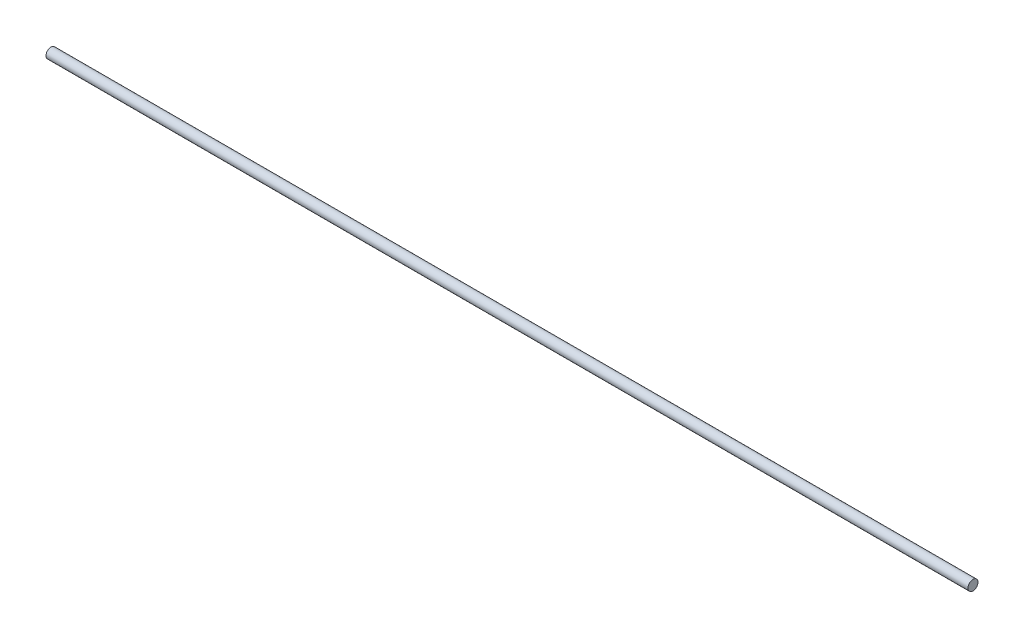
ISO-10303-21;
HEADER;
FILE_DESCRIPTION(('STEP AP214'),'2;1');
FILE_NAME('part.step','',(''),(''),'','','');
FILE_SCHEMA(('AUTOMOTIVE_DESIGN { 1 0 10303 214 1 1 1 1 }'));
ENDSEC;
DATA;
#1=APPLICATION_CONTEXT('core data for automotive mechanical design processes');
#2=APPLICATION_PROTOCOL_DEFINITION('international standard','automotive_design',2000,#1);
#3=PRODUCT_CONTEXT('',#1,'mechanical');
#4=PRODUCT('Part','Part','',(#3));
#5=PRODUCT_RELATED_PRODUCT_CATEGORY('part','',(#4));
#6=PRODUCT_DEFINITION_FORMATION('','',#4);
#7=PRODUCT_DEFINITION_CONTEXT('part definition',#1,'design');
#8=PRODUCT_DEFINITION('design','',#6,#7);
#9=PRODUCT_DEFINITION_SHAPE('','',#8);
#10=(LENGTH_UNIT() NAMED_UNIT(*) SI_UNIT(.MILLI.,.METRE.));
#11=(NAMED_UNIT(*) PLANE_ANGLE_UNIT() SI_UNIT($,.RADIAN.));
#12=(NAMED_UNIT(*) SI_UNIT($,.STERADIAN.) SOLID_ANGLE_UNIT());
#13=UNCERTAINTY_MEASURE_WITH_UNIT(LENGTH_MEASURE(1.E-05),#10,'distance_accuracy_value','');
#14=(GEOMETRIC_REPRESENTATION_CONTEXT(3) GLOBAL_UNCERTAINTY_ASSIGNED_CONTEXT((#13)) GLOBAL_UNIT_ASSIGNED_CONTEXT((#10,
#11,#12)) REPRESENTATION_CONTEXT('',''));
#15=CARTESIAN_POINT('',(0.,0.,0.));
#16=DIRECTION('',(0.,0.,1.));
#17=DIRECTION('',(1.,0.,0.));
#18=AXIS2_PLACEMENT_3D('',#15,#16,#17);
#19=CARTESIAN_POINT('',(1318.225,1.56141766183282E-09,-7.105427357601E-12));
#20=DIRECTION('',(-1.00000000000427,0.,0.));
#21=DIRECTION('',(0.,0.,1.));
#22=AXIS2_PLACEMENT_3D('',#19,#20,#21);
#23=CYLINDRICAL_SURFACE('',#22,14.3256);
#24=CARTESIAN_POINT('',(1318.225,1.56141766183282E-09,-7.105427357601E-12));
#25=DIRECTION('',(1.00000000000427,0.,0.));
#26=DIRECTION('',(0.,0.,-1.));
#27=AXIS2_PLACEMENT_3D('',#24,#25,#26);
#28=CIRCLE('',#27,14.3256);
#29=CARTESIAN_POINT('',(1318.225,1.56141766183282E-09,-14.3256000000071));
#30=VERTEX_POINT('',#29);
#31=EDGE_CURVE('E10',#30,#30,#28,.T.);
#32=ORIENTED_EDGE('',*,*,#31,.F.);
#33=EDGE_LOOP('',(#32));
#34=FACE_BOUND('',#33,.T.);
#35=CARTESIAN_POINT('',(-1318.225,-1.55075952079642E-09,-3.5527136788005E-11));
#36=DIRECTION('',(1.00000000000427,0.,0.));
#37=DIRECTION('',(0.,0.,-1.));
#38=AXIS2_PLACEMENT_3D('',#35,#36,#37);
#39=CIRCLE('',#38,14.3256);
#40=CARTESIAN_POINT('',(-1318.225,-1.55075952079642E-09,-14.3256000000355));
#41=VERTEX_POINT('',#40);
#42=EDGE_CURVE('E45',#41,#41,#39,.T.);
#43=ORIENTED_EDGE('',*,*,#42,.T.);
#44=EDGE_LOOP('',(#43));
#45=FACE_BOUND('',#44,.T.);
#46=ADVANCED_FACE('F39',(#34,#45),#23,.T.);
#47=CARTESIAN_POINT('',(1318.225,1.56141766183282E-09,-7.105427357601E-12));
#48=DIRECTION('',(1.00000000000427,0.,0.));
#49=DIRECTION('',(0.,0.,-1.));
#50=AXIS2_PLACEMENT_3D('',#47,#48,#49);
#51=PLANE('',#50);
#52=ORIENTED_EDGE('',*,*,#31,.T.);
#53=EDGE_LOOP('',(#52));
#54=FACE_BOUND('',#53,.T.);
#55=ADVANCED_FACE('F59',(#54),#51,.T.);
#56=CARTESIAN_POINT('',(-1318.225,-1.55075952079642E-09,-3.5527136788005E-11));
#57=DIRECTION('',(1.00000000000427,0.,0.));
#58=DIRECTION('',(0.,0.,-1.));
#59=AXIS2_PLACEMENT_3D('',#56,#57,#58);
#60=PLANE('',#59);
#61=ORIENTED_EDGE('',*,*,#42,.F.);
#62=EDGE_LOOP('',(#61));
#63=FACE_BOUND('',#62,.T.);
#64=ADVANCED_FACE('F57',(#63),#60,.F.);
#65=CLOSED_SHELL('',(#46,#55,#64));
#66=MANIFOLD_SOLID_BREP('B2',#65);
#67=ADVANCED_BREP_SHAPE_REPRESENTATION('',(#18,#66),#14);
#68=SHAPE_DEFINITION_REPRESENTATION(#9,#67);
ENDSEC;
END-ISO-10303-21;
